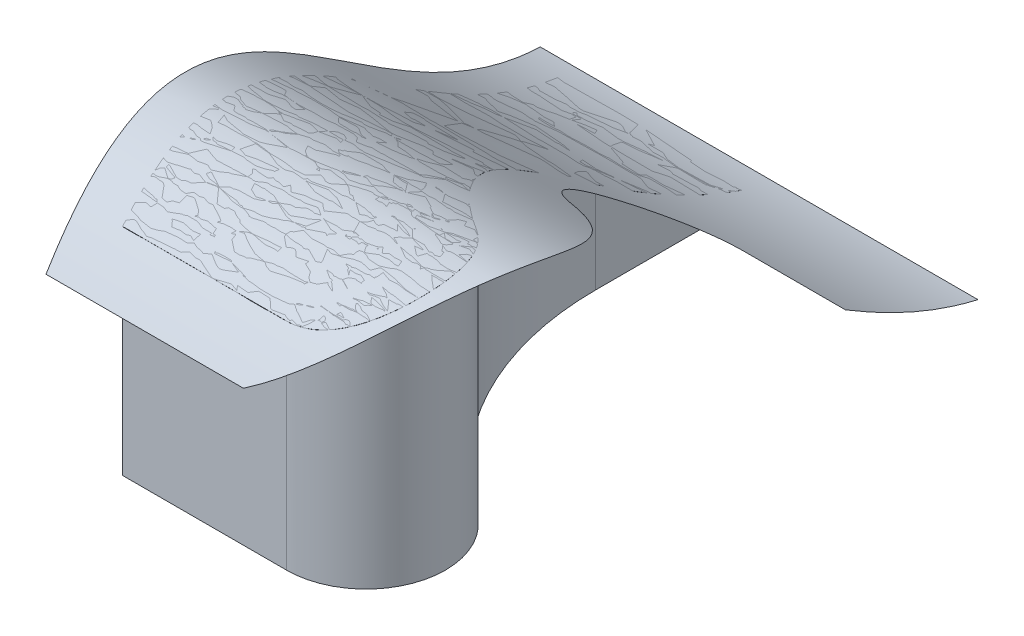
ISO-10303-21;
HEADER;
FILE_DESCRIPTION(('STEP AP214'),'2;1');
FILE_NAME('part.step','',(''),(''),'','','');
FILE_SCHEMA(('AUTOMOTIVE_DESIGN { 1 0 10303 214 1 1 1 1 }'));
ENDSEC;
DATA;
#1=APPLICATION_CONTEXT('core data for automotive mechanical design processes');
#2=APPLICATION_PROTOCOL_DEFINITION('international standard','automotive_design',2000,#1);
#3=PRODUCT_CONTEXT('',#1,'mechanical');
#4=PRODUCT('Part','Part','',(#3));
#5=PRODUCT_RELATED_PRODUCT_CATEGORY('part','',(#4));
#6=PRODUCT_DEFINITION_FORMATION('','',#4);
#7=PRODUCT_DEFINITION_CONTEXT('part definition',#1,'design');
#8=PRODUCT_DEFINITION('design','',#6,#7);
#9=PRODUCT_DEFINITION_SHAPE('','',#8);
#10=(LENGTH_UNIT() NAMED_UNIT(*) SI_UNIT(.MILLI.,.METRE.));
#11=(NAMED_UNIT(*) PLANE_ANGLE_UNIT() SI_UNIT($,.RADIAN.));
#12=(NAMED_UNIT(*) SI_UNIT($,.STERADIAN.) SOLID_ANGLE_UNIT());
#13=UNCERTAINTY_MEASURE_WITH_UNIT(LENGTH_MEASURE(1.E-05),#10,'distance_accuracy_value','');
#14=(GEOMETRIC_REPRESENTATION_CONTEXT(3) GLOBAL_UNCERTAINTY_ASSIGNED_CONTEXT((#13)) GLOBAL_UNIT_ASSIGNED_CONTEXT((#10,
#11,#12)) REPRESENTATION_CONTEXT('',''));
#15=CARTESIAN_POINT('',(0.,0.,0.));
#16=DIRECTION('',(0.,0.,1.));
#17=DIRECTION('',(1.,0.,0.));
#18=AXIS2_PLACEMENT_3D('',#15,#16,#17);
#19=CARTESIAN_POINT('',(-50.8,-4.61815557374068,50.2563988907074));
#20=CARTESIAN_POINT('',(-50.8,81.4124609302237,13.8907957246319));
#21=CARTESIAN_POINT('',(-50.8,-15.5554107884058,-14.6119008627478));
#22=CARTESIAN_POINT('',(-50.8,1.62993726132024,-62.2092721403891));
#23=B_SPLINE_CURVE_WITH_KNOTS('',3,(#19,#20,#21,#22),.UNSPECIFIED.,.F.,.F.,(4,4),(0.,1.),.UNSPECIFIED.);
#24=DIRECTION('',(1.,0.,0.));
#25=VECTOR('',#24,1.);
#26=SURFACE_OF_LINEAR_EXTRUSION('',#23,#25);
#27=DIRECTION('',(1.,0.,0.));
#28=VECTOR('',#27,1.);
#29=CARTESIAN_POINT('',(4.59182488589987,1.32705179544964,-39.379349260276));
#30=LINE('',#29,#28);
#31=CARTESIAN_POINT('',(-17.4066623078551,1.32705179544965,-39.379349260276));
#32=VERTEX_POINT('',#31);
#33=CARTESIAN_POINT('',(6.68799385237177,1.32705179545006,-39.3793492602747));
#34=VERTEX_POINT('',#33);
#35=EDGE_CURVE('E103',#32,#34,#30,.T.);
#36=ORIENTED_EDGE('',*,*,#35,.F.);
#37=CARTESIAN_POINT('',(-2.81317454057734,27.0247550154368,29.6964928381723));
#38=CARTESIAN_POINT('',(-2.86577040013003,27.2133397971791,29.4475391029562));
#39=CARTESIAN_POINT('',(-2.91901082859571,27.3977581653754,29.1955344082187));
#40=CARTESIAN_POINT('',(-3.02687731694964,27.7578038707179,28.6849663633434));
#41=CARTESIAN_POINT('',(-3.08150554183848,27.9334160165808,28.4263927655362));
#42=CARTESIAN_POINT('',(-3.19211366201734,28.2748955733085,27.9028476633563));
#43=CARTESIAN_POINT('',(-3.24809462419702,28.4407549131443,27.6378711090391));
#44=CARTESIAN_POINT('',(-3.36136592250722,28.7618027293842,27.1017202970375));
#45=CARTESIAN_POINT('',(-3.41865651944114,28.9169890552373,26.8305448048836));
#46=CARTESIAN_POINT('',(-3.53462796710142,29.2161457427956,26.2816132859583));
#47=CARTESIAN_POINT('',(-3.59331141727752,29.3600925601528,26.0038449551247));
#48=CARTESIAN_POINT('',(-3.71188550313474,29.6355508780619,25.4425942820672));
#49=CARTESIAN_POINT('',(-3.77177565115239,29.7670672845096,25.159114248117));
#50=CARTESIAN_POINT('',(-3.89269970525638,30.0169103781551,24.5867403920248));
#51=CARTESIAN_POINT('',(-3.95373323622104,30.1352413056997,24.2978483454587));
#52=CARTESIAN_POINT('',(-4.07686955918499,30.35804083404,23.7150030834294));
#53=CARTESIAN_POINT('',(-4.13897232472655,30.4625097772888,23.4210499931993));
#54=CARTESIAN_POINT('',(-4.28585107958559,30.6906847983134,22.7258238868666));
#55=CARTESIAN_POINT('',(-4.37102199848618,30.8085003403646,22.3226815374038));
#56=CARTESIAN_POINT('',(-4.54280534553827,31.0166932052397,21.5095736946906));
#57=CARTESIAN_POINT('',(-4.6294181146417,31.1070639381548,21.099606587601));
#58=CARTESIAN_POINT('',(-4.80368942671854,31.2596779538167,20.2747223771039));
#59=CARTESIAN_POINT('',(-4.8913478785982,31.3219236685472,19.8598057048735));
#60=CARTESIAN_POINT('',(-5.06699950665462,31.4180500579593,19.0283879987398));
#61=CARTESIAN_POINT('',(-5.15499028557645,31.4520336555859,18.6118983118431));
#62=CARTESIAN_POINT('',(-5.33124373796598,31.4925266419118,17.7776319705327));
#63=CARTESIAN_POINT('',(-5.41950642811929,31.4990343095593,17.3598552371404));
#64=CARTESIAN_POINT('',(-5.59593939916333,31.4855967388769,16.5247391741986));
#65=CARTESIAN_POINT('',(-5.68410967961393,31.4656513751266,16.1073998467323));
#66=CARTESIAN_POINT('',(-5.87355613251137,31.3957532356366,15.2106866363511));
#67=CARTESIAN_POINT('',(-5.97476704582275,31.3416650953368,14.7316216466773));
#68=CARTESIAN_POINT('',(-6.17629545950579,31.2028406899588,13.7777204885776));
#69=CARTESIAN_POINT('',(-6.27661275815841,31.1180976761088,13.3028852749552));
#70=CARTESIAN_POINT('',(-6.4760748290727,30.9208789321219,12.3587648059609));
#71=CARTESIAN_POINT('',(-6.57521949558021,30.8084007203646,11.8894800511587));
#72=CARTESIAN_POINT('',(-6.77260954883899,30.5581030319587,10.9551671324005));
#73=CARTESIAN_POINT('',(-6.87084870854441,30.4201694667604,10.4901684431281));
#74=CARTESIAN_POINT('',(-7.06585574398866,30.1222306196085,9.56713514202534));
#75=CARTESIAN_POINT('',(-7.162623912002,29.9622297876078,9.10909914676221));
#76=CARTESIAN_POINT('',(-7.35466498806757,29.6228661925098,8.20010472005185));
#77=CARTESIAN_POINT('',(-7.4499382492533,29.4435080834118,7.74914461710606));
#78=CARTESIAN_POINT('',(-7.63504118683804,29.0757858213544,6.87299071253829));
#79=CARTESIAN_POINT('',(-7.72493069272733,28.8881232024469,6.44751371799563));
#80=CARTESIAN_POINT('',(-7.90344503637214,28.4991597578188,5.60254582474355));
#81=CARTESIAN_POINT('',(-7.99206976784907,28.2978577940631,5.18305542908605));
#82=CARTESIAN_POINT('',(-8.16818669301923,27.8831876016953,4.34943531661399));
#83=CARTESIAN_POINT('',(-8.25567794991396,27.6698100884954,3.93531003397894));
#84=CARTESIAN_POINT('',(-8.4295456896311,27.2326489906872,3.11233606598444));
#85=CARTESIAN_POINT('',(-8.51592211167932,27.008864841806,2.70348766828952));
#86=CARTESIAN_POINT('',(-8.68780040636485,26.5518473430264,1.88993040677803));
#87=CARTESIAN_POINT('',(-8.77330042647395,26.318597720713,1.48523031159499));
#88=CARTESIAN_POINT('',(-8.94336358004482,25.8442256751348,0.680264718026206));
#89=CARTESIAN_POINT('',(-9.02792668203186,25.6031029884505,0.279999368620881));
#90=CARTESIAN_POINT('',(-9.2805653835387,24.8689535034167,-0.915823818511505));
#91=CARTESIAN_POINT('',(-9.44737501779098,24.3657247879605,-1.70538942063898));
#92=CARTESIAN_POINT('',(-9.77832512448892,23.3395542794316,-3.27188659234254));
#93=CARTESIAN_POINT('',(-9.94246599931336,22.8166154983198,-4.04882006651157));
#94=CARTESIAN_POINT('',(-10.2699464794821,21.753186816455,-5.59889433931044));
#95=CARTESIAN_POINT('',(-10.4332726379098,21.2126003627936,-6.37197148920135));
#96=CARTESIAN_POINT('',(-10.758392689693,20.1232699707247,-7.9108730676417));
#97=CARTESIAN_POINT('',(-10.9201885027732,19.5745393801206,-8.67670658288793));
#98=CARTESIAN_POINT('',(-11.2429955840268,18.4729530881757,-10.204660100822));
#99=CARTESIAN_POINT('',(-11.4040073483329,17.9201007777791,-10.9667824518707));
#100=CARTESIAN_POINT('',(-11.7259327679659,16.8138968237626,-12.4905627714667));
#101=CARTESIAN_POINT('',(-11.8868464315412,16.2605452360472,-13.2522207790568));
#102=CARTESIAN_POINT('',(-12.2092270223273,15.1567254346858,-14.7781555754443));
#103=CARTESIAN_POINT('',(-12.3706941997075,14.6062589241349,-15.542433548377));
#104=CARTESIAN_POINT('',(-12.659136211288,13.6320124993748,-16.9077257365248));
#105=CARTESIAN_POINT('',(-12.7859180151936,13.2068977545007,-17.5078262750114));
#106=CARTESIAN_POINT('',(-13.0403744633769,12.3624345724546,-18.7122534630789));
#107=CARTESIAN_POINT('',(-13.1680494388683,11.9430884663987,-19.3165816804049));
#108=CARTESIAN_POINT('',(-13.4244653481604,11.1121800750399,-20.5302836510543));
#109=CARTESIAN_POINT('',(-13.5532062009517,10.7006172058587,-21.139657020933));
#110=CARTESIAN_POINT('',(-13.8119309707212,9.88732216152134,-22.3642875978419));
#111=CARTESIAN_POINT('',(-13.9419143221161,9.48558578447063,-22.979542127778));
#112=CARTESIAN_POINT('',(-14.2033076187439,8.69403789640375,-24.2168037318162));
#113=CARTESIAN_POINT('',(-14.3347165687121,8.30421871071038,-24.8388060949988));
#114=CARTESIAN_POINT('',(-14.5991535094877,7.53866547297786,-26.090474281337));
#115=CARTESIAN_POINT('',(-14.7321802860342,7.16292162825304,-26.7201343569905));
#116=CARTESIAN_POINT('',(-15.0003728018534,6.42689955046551,-27.9895789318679));
#117=CARTESIAN_POINT('',(-15.1355419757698,6.06665053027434,-28.6293796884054));
#118=CARTESIAN_POINT('',(-15.4079385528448,5.36492059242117,-29.9187234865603));
#119=CARTESIAN_POINT('',(-15.5451657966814,5.02343823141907,-30.5682657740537));
#120=CARTESIAN_POINT('',(-15.8219079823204,4.36178140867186,-31.8781787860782));
#121=CARTESIAN_POINT('',(-15.9614242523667,4.04161990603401,-32.5385557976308));
#122=CARTESIAN_POINT('',(-16.2429889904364,3.42532273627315,-33.8712955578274));
#123=CARTESIAN_POINT('',(-16.3850412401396,3.12922738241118,-34.5436762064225));
#124=CARTESIAN_POINT('',(-16.6719487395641,2.56398368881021,-35.9017050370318));
#125=CARTESIAN_POINT('',(-16.8168113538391,2.2949223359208,-36.5873880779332));
#126=CARTESIAN_POINT('',(-17.1096114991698,1.78694056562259,-37.973308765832));
#127=CARTESIAN_POINT('',(-17.2575609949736,1.54818190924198,-38.6736030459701));
#128=CARTESIAN_POINT('',(-17.4066623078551,1.32705179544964,-39.379349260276));
#129=B_SPLINE_CURVE_WITH_KNOTS('',3,(#37,#38,#39,#40,#41,#42,#43,#44,#45,#46,#47,#48,#49,#50,
#51,#52,#53,#54,#55,#56,#57,#58,#59,#60,#61,#62,#63,#64,#65,#66,#67,#68,#69,#70,#71,#72,#73,#74,
#75,#76,#77,#78,#79,#80,#81,#82,#83,#84,#85,#86,#87,#88,#89,#90,#91,#92,#93,#94,#95,#96,#97,#98,
#99,#100,#101,#102,#103,#104,#105,#106,#107,#108,#109,#110,#111,#112,#113,#114,#115,#116,#117,
#118,#119,#120,#121,#122,#123,#124,#125,#126,#127,#128),.UNSPECIFIED.,.F.,.F.,(4,2,2,2,2,2,2,2,
2,2,2,2,2,2,2,2,2,2,2,2,2,2,2,2,2,2,2,2,2,2,2,2,2,2,2,2,2,2,2,2,2,2,2,2,2,4),(0.,
0.95013908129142,1.90186448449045,2.85436672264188,3.8070603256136,4.76169886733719,
5.71595905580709,6.66991147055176,7.62384031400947,8.90854631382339,10.193560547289,
11.4784636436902,12.7586667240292,14.0389499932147,15.3192393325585,16.7960093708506,
18.2731047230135,19.750332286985,21.2343489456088,22.7180667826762,24.2014286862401,
25.6220655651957,27.0428211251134,28.4646843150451,29.8866246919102,31.3111227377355,
32.7356684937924,35.5883345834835,38.4405665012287,41.3125748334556,44.1803059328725,
47.045892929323,49.9111912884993,52.7780243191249,55.0168052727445,57.2564658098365,
59.4959576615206,61.7344745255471,63.9715180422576,66.2069751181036,68.4464769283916,
70.6858062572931,72.9264844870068,75.1708418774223,77.4222039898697,79.6851195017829),.UNSPECIFIED.);
#130=CARTESIAN_POINT('',(-2.81317454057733,27.0247550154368,29.6964928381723));
#131=VERTEX_POINT('',#130);
#132=EDGE_CURVE('E109',#131,#32,#129,.T.);
#133=ORIENTED_EDGE('',*,*,#132,.F.);
#134=DIRECTION('',(1.,0.,0.));
#135=VECTOR('',#134,1.);
#136=CARTESIAN_POINT('',(4.59182488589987,27.0247550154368,29.6964928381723));
#137=LINE('',#136,#135);
#138=CARTESIAN_POINT('',(17.7258082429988,27.0247550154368,29.6964928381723));
#139=VERTEX_POINT('',#138);
#140=EDGE_CURVE('E159',#139,#131,#137,.F.);
#141=ORIENTED_EDGE('',*,*,#140,.F.);
#142=CARTESIAN_POINT('',(23.3470035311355,30.7133704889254,11.5357080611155));
#143=CARTESIAN_POINT('',(23.5765390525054,30.7547322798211,11.6928392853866));
#144=CARTESIAN_POINT('',(23.7993347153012,30.7971264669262,11.8595273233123));
#145=CARTESIAN_POINT('',(24.2301638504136,30.8824133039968,12.21091579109));
#146=CARTESIAN_POINT('',(24.43819626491,30.9253059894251,12.3956175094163));
#147=CARTESIAN_POINT('',(24.8387375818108,31.0101345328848,12.7824446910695));
#148=CARTESIAN_POINT('',(25.0312018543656,31.0520674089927,12.9846170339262));
#149=CARTESIAN_POINT('',(25.398713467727,31.1331717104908,13.4047296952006));
#150=CARTESIAN_POINT('',(25.5737613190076,31.1723432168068,13.6226695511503));
#151=CARTESIAN_POINT('',(25.9054902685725,31.2462644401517,14.0733703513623));
#152=CARTESIAN_POINT('',(26.062141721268,31.281007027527,14.3061543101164));
#153=CARTESIAN_POINT('',(26.3555475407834,31.3442528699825,14.7847403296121));
#154=CARTESIAN_POINT('',(26.4923033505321,31.3727565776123,15.0305414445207));
#155=CARTESIAN_POINT('',(26.7446029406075,31.4217923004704,15.5331334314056));
#156=CARTESIAN_POINT('',(26.8601769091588,31.4423357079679,15.7899080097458));
#157=CARTESIAN_POINT('',(27.0693036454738,31.4739268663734,16.3128425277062));
#158=CARTESIAN_POINT('',(27.1628579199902,31.4849752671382,16.5790018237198));
#159=CARTESIAN_POINT('',(27.3231037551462,31.4959320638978,17.1054747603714));
#160=CARTESIAN_POINT('',(27.3908751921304,31.4963531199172,17.3654490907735));
#161=CARTESIAN_POINT('',(27.5051401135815,31.4864211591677,17.8898353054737));
#162=CARTESIAN_POINT('',(27.5516343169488,31.4760685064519,18.1542470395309));
#163=CARTESIAN_POINT('',(27.6230562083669,31.4439791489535,18.6852582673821));
#164=CARTESIAN_POINT('',(27.6479859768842,31.4222435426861,18.9518575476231));
#165=CARTESIAN_POINT('',(27.676300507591,31.3671488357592,19.4849903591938));
#166=CARTESIAN_POINT('',(27.6796861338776,31.3337902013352,19.7515238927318));
#167=CARTESIAN_POINT('',(27.6657405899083,31.2583164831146,20.2639055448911));
#168=CARTESIAN_POINT('',(27.6498284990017,31.2169682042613,20.5099074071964));
#169=CARTESIAN_POINT('',(27.6001029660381,31.1247552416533,20.9982695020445));
#170=CARTESIAN_POINT('',(27.5662905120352,31.0738910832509,21.2406299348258));
#171=CARTESIAN_POINT('',(27.4813976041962,30.9632987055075,21.7202480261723));
#172=CARTESIAN_POINT('',(27.430316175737,30.9035699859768,21.9575053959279));
#173=CARTESIAN_POINT('',(27.3116266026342,30.7761025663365,22.4256419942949));
#174=CARTESIAN_POINT('',(27.2440176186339,30.7083634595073,22.6565208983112));
#175=CARTESIAN_POINT('',(27.0893976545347,30.5624152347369,23.1218674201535));
#176=CARTESIAN_POINT('',(27.0016042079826,30.4838575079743,23.3559652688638));
#177=CARTESIAN_POINT('',(26.8095855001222,30.3202711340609,23.8150838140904));
#178=CARTESIAN_POINT('',(26.7053532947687,30.2352397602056,24.0401006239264));
#179=CARTESIAN_POINT('',(26.4812978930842,30.0600480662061,24.48024898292));
#180=CARTESIAN_POINT('',(26.3614692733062,29.9698859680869,24.6953770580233));
#181=CARTESIAN_POINT('',(26.1070115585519,29.7858450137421,25.1150371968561));
#182=CARTESIAN_POINT('',(25.9723810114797,29.6919657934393,25.3195682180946));
#183=CARTESIAN_POINT('',(25.668401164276,29.4881053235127,25.746380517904));
#184=CARTESIAN_POINT('',(25.4968492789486,29.3777657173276,25.9669255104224));
#185=CARTESIAN_POINT('',(25.1360485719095,29.1562505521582,26.3926153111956));
#186=CARTESIAN_POINT('',(24.9467975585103,29.0450748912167,26.5977582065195));
#187=CARTESIAN_POINT('',(24.5512124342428,28.8240837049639,26.9919187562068));
#188=CARTESIAN_POINT('',(24.3448691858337,28.7142689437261,27.1809276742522));
#189=CARTESIAN_POINT('',(23.9158369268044,28.4984110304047,27.5417514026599));
#190=CARTESIAN_POINT('',(23.693149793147,28.3923674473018,27.7135681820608));
#191=CARTESIAN_POINT('',(23.2541153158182,28.196344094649,28.0233625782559));
#192=CARTESIAN_POINT('',(23.0391954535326,28.1057976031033,28.1630048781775));
#193=CARTESIAN_POINT('',(22.5971144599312,27.931710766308,28.4263495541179));
#194=CARTESIAN_POINT('',(22.3699553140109,27.8481692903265,28.5500545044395));
#195=CARTESIAN_POINT('',(21.904775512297,27.6902689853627,28.7801241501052));
#196=CARTESIAN_POINT('',(21.6667862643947,27.6158856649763,28.8865353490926));
#197=CARTESIAN_POINT('',(21.1804279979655,27.4780168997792,29.0812187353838));
#198=CARTESIAN_POINT('',(20.9320596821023,27.4145307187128,29.1694921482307));
#199=CARTESIAN_POINT('',(20.4451176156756,27.3045901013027,29.3208443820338));
#200=CARTESIAN_POINT('',(20.2071807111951,27.2572225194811,29.3853049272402));
#201=CARTESIAN_POINT('',(19.725182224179,27.1748274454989,29.4966880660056));
#202=CARTESIAN_POINT('',(19.4811220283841,27.1397971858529,29.5436145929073));
#203=CARTESIAN_POINT('',(18.986458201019,27.0829164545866,29.6195078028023));
#204=CARTESIAN_POINT('',(18.7358162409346,27.0611825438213,29.6483157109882));
#205=CARTESIAN_POINT('',(18.3580945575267,27.0393677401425,29.6771888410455));
#206=CARTESIAN_POINT('',(18.2318192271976,27.0338937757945,29.6844234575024));
#207=CARTESIAN_POINT('',(17.9789719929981,27.0265857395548,29.6940763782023));
#208=CARTESIAN_POINT('',(17.8524000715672,27.0247518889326,29.6964943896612));
#209=CARTESIAN_POINT('',(17.7258082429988,27.0247550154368,29.6964928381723));
#210=B_SPLINE_CURVE_WITH_KNOTS('',3,(#142,#143,#144,#145,#146,#147,#148,#149,#150,#151,#152,
#153,#154,#155,#156,#157,#158,#159,#160,#161,#162,#163,#164,#165,#166,#167,#168,#169,#170,#171,
#172,#173,#174,#175,#176,#177,#178,#179,#180,#181,#182,#183,#184,#185,#186,#187,#188,#189,#190,
#191,#192,#193,#194,#195,#196,#197,#198,#199,#200,#201,#202,#203,#204,#205,#206,#207,#208,#209),
.UNSPECIFIED.,.F.,.F.,(4,2,2,2,2,2,2,2,2,2,2,2,2,2,2,2,2,2,2,2,2,2,2,2,2,2,2,2,2,2,2,2,2,4),(0.,
0.843420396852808,1.68690116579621,2.53272007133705,3.37851417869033,4.22565309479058,
5.07273054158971,5.91859118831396,6.76439393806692,7.56931313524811,8.37420513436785,
9.17901947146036,9.98380152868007,10.732825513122,11.4818081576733,12.230833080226,
12.9798960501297,13.7653179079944,14.5510724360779,15.337100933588,16.1232066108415,
17.0234829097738,17.9238708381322,18.824743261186,19.725512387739,20.540209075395,
21.3547740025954,22.1671109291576,22.9793929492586,23.7315185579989,24.4834753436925,
25.2419329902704,25.6216098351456,26.0013097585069),.UNSPECIFIED.);
#211=CARTESIAN_POINT('',(23.3470035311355,30.7133704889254,11.5357080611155));
#212=VERTEX_POINT('',#211);
#213=EDGE_CURVE('E155',#212,#139,#210,.T.);
#214=ORIENTED_EDGE('',*,*,#213,.F.);
#215=CARTESIAN_POINT('',(6.68799385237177,11.4349415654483,-20.0589654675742));
#216=CARTESIAN_POINT('',(6.68799724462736,11.6618463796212,-19.7268533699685));
#217=CARTESIAN_POINT('',(6.69231444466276,11.8899067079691,-19.3955511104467));
#218=CARTESIAN_POINT('',(6.70947825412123,12.3479507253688,-18.7345106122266));
#219=CARTESIAN_POINT('',(6.72232467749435,12.5779343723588,-18.4047723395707));
#220=CARTESIAN_POINT('',(6.77356075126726,13.2708797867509,-17.4168345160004));
#221=CARTESIAN_POINT('',(6.82464665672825,13.736169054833,-16.7608845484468));
#222=CARTESIAN_POINT('',(6.96023220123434,14.6702383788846,-15.4539754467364));
#223=CARTESIAN_POINT('',(7.04476597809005,15.1390215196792,-14.8030221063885));
#224=CARTESIAN_POINT('',(7.24719065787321,16.0767503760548,-13.5059843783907));
#225=CARTESIAN_POINT('',(7.36509637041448,16.5456960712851,-12.859902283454));
#226=CARTESIAN_POINT('',(7.63713846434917,17.489537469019,-11.5598979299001));
#227=CARTESIAN_POINT('',(7.79193679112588,17.9643707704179,-10.9060686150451));
#228=CARTESIAN_POINT('',(8.13704750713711,18.9071514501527,-9.60321953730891));
#229=CARTESIAN_POINT('',(8.32734569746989,19.3751015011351,-8.95419795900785));
#230=CARTESIAN_POINT('',(8.74438808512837,20.3004729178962,-7.66093519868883));
#231=CARTESIAN_POINT('',(8.97111166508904,20.7579000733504,-7.01669152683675));
#232=CARTESIAN_POINT('',(9.46232774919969,21.6585700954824,-5.7329931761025));
#233=CARTESIAN_POINT('',(9.72680600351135,22.1018182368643,-5.09353678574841));
#234=CARTESIAN_POINT('',(10.1847413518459,22.8015651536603,-4.0672390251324));
#235=CARTESIAN_POINT('',(10.365889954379,23.0637368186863,-3.67873846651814));
#236=CARTESIAN_POINT('',(10.7432878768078,23.5803430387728,-2.90395314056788));
#237=CARTESIAN_POINT('',(10.9395361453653,23.8347781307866,-2.51766822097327));
#238=CARTESIAN_POINT('',(11.3475054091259,24.334910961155,-1.7476603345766));
#239=CARTESIAN_POINT('',(11.5592252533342,24.5806093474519,-1.36393717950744));
#240=CARTESIAN_POINT('',(11.9985430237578,25.062305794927,-0.599417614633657));
#241=CARTESIAN_POINT('',(12.2261426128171,25.2983028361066,-0.218621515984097));
#242=CARTESIAN_POINT('',(12.6953371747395,25.7574070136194,0.535921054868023));
#243=CARTESIAN_POINT('',(12.9367820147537,25.9806137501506,0.909700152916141));
#244=CARTESIAN_POINT('',(13.4358551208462,26.4155385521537,1.65318929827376));
#245=CARTESIAN_POINT('',(13.6934847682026,26.6272556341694,2.02289899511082));
#246=CARTESIAN_POINT('',(14.2250714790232,27.0382356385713,2.75740854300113));
#247=CARTESIAN_POINT('',(14.4990267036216,27.2374999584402,3.12220894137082));
#248=CARTESIAN_POINT('',(15.0633597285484,27.6227376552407,3.84603065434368));
#249=CARTESIAN_POINT('',(15.3537358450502,27.8087123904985,4.2050525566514));
#250=CARTESIAN_POINT('',(15.9199881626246,28.1481290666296,4.87954255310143));
#251=CARTESIAN_POINT('',(16.1942536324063,28.302945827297,5.19567193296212));
#252=CARTESIAN_POINT('',(16.7558713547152,28.6009057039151,5.82176409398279));
#253=CARTESIAN_POINT('',(17.0432237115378,28.7440487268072,6.1317268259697));
#254=CARTESIAN_POINT('',(17.6307929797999,29.0183424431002,6.74465910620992));
#255=CARTESIAN_POINT('',(17.9310092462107,29.1494937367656,7.04762900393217));
#256=CARTESIAN_POINT('',(18.5440139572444,29.3996358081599,7.64575428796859));
#257=CARTESIAN_POINT('',(18.8568020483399,29.5186269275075,7.94090989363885));
#258=CARTESIAN_POINT('',(19.4994578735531,29.7461572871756,8.52703771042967));
#259=CARTESIAN_POINT('',(19.8295138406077,29.8545085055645,8.81787658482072));
#260=CARTESIAN_POINT('',(20.5017393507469,30.0588048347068,9.3898215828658));
#261=CARTESIAN_POINT('',(20.8439101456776,30.1547486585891,9.67092669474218));
#262=CARTESIAN_POINT('',(21.5398604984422,30.3345382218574,10.2226180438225));
#263=CARTESIAN_POINT('',(21.893642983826,30.4183808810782,10.4932015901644));
#264=CARTESIAN_POINT('',(22.6122360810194,30.5744652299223,11.0231146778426));
#265=CARTESIAN_POINT('',(22.9770506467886,30.6467027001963,11.2824401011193));
#266=CARTESIAN_POINT('',(23.3470035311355,30.7133704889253,11.5357080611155));
#267=B_SPLINE_CURVE_WITH_KNOTS('',3,(#215,#216,#217,#218,#219,#220,#221,#222,#223,#224,#225,
#226,#227,#228,#229,#230,#231,#232,#233,#234,#235,#236,#237,#238,#239,#240,#241,#242,#243,#244,
#245,#246,#247,#248,#249,#250,#251,#252,#253,#254,#255,#256,#257,#258,#259,#260,#261,#262,#263,
#264,#265,#266),.UNSPECIFIED.,.F.,.F.,(4,2,2,2,2,2,2,2,2,2,2,2,2,2,2,2,2,2,2,2,2,2,2,2,2,4),(0.,
1.2066157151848,2.41320511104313,4.82991878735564,7.24910541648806,9.66936730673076,
12.1368458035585,14.6033394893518,17.0684419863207,19.532616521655,21.0397907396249,
22.5468601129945,24.05381748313,25.5609328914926,27.054008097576,28.5472109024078,
30.0402458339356,31.5331279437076,32.8714675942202,34.2098179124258,35.5481012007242,
36.8863468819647,38.245091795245,39.6039775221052,40.9632085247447,42.3229325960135),.UNSPECIFIED.);
#268=CARTESIAN_POINT('',(6.68799385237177,11.4349415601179,-20.0589654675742));
#269=VERTEX_POINT('',#268);
#270=EDGE_CURVE('E67',#269,#212,#267,.T.);
#271=ORIENTED_EDGE('',*,*,#270,.F.);
#272=CARTESIAN_POINT('',(6.68799385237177,-4.61815557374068,50.2563988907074));
#273=CARTESIAN_POINT('',(6.68799385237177,81.4124609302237,13.8907957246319));
#274=CARTESIAN_POINT('',(6.68799385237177,-15.5554107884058,-14.6119008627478));
#275=CARTESIAN_POINT('',(6.68799385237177,1.62993726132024,-62.2092721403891));
#276=B_SPLINE_CURVE_WITH_KNOTS('',3,(#272,#273,#274,#275),.UNSPECIFIED.,.F.,.F.,(4,4),(0.,1.),.UNSPECIFIED.);
#277=EDGE_CURVE('E12',#34,#269,#276,.F.);
#278=ORIENTED_EDGE('',*,*,#277,.F.);
#279=EDGE_LOOP('',(#36,#133,#141,#214,#271,#278));
#280=FACE_BOUND('',#279,.T.);
#281=ADVANCED_FACE('F50',(#280),#26,.F.);
#282=CARTESIAN_POINT('',(6.68799385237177,101.6,-39.379349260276));
#283=DIRECTION('',(0.,0.,1.));
#284=DIRECTION('',(1.,0.,0.));
#285=AXIS2_PLACEMENT_3D('',#282,#283,#284);
#286=PLANE('',#285);
#287=DIRECTION('',(0.,-1.,0.));
#288=VECTOR('',#287,1.);
#289=CARTESIAN_POINT('',(-17.4066623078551,101.6,-39.379349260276));
#290=LINE('',#289,#288);
#291=CARTESIAN_POINT('',(-17.4066623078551,0.,-39.379349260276));
#292=VERTEX_POINT('',#291);
#293=EDGE_CURVE('E60',#32,#292,#290,.T.);
#294=ORIENTED_EDGE('',*,*,#293,.F.);
#295=ORIENTED_EDGE('',*,*,#35,.T.);
#296=DIRECTION('',(0.,-1.,0.));
#297=VECTOR('',#296,1.);
#298=CARTESIAN_POINT('',(6.68799385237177,101.6,-39.379349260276));
#299=LINE('',#298,#297);
#300=CARTESIAN_POINT('',(6.68799385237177,0.,-39.379349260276));
#301=VERTEX_POINT('',#300);
#302=EDGE_CURVE('E74',#34,#301,#299,.T.);
#303=ORIENTED_EDGE('',*,*,#302,.T.);
#304=DIRECTION('',(-1.,0.,0.));
#305=VECTOR('',#304,1.);
#306=CARTESIAN_POINT('',(6.68799385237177,0.,-39.379349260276));
#307=LINE('',#306,#305);
#308=EDGE_CURVE('E108',#301,#292,#307,.T.);
#309=ORIENTED_EDGE('',*,*,#308,.T.);
#310=EDGE_LOOP('',(#294,#295,#303,#309));
#311=FACE_BOUND('',#310,.T.);
#312=ADVANCED_FACE('F52',(#311),#286,.F.);
#313=CARTESIAN_POINT('',(-17.4066623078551,101.6,-39.379349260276));
#314=DIRECTION('',(0.97840332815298,0.,-0.206704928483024));
#315=DIRECTION('',(-0.206704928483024,0.,-0.97840332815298));
#316=AXIS2_PLACEMENT_3D('',#313,#314,#315);
#317=PLANE('',#316);
#318=DIRECTION('',(0.,-1.,0.));
#319=VECTOR('',#318,1.);
#320=CARTESIAN_POINT('',(-2.81317454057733,101.6,29.6964928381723));
#321=LINE('',#320,#319);
#322=CARTESIAN_POINT('',(-2.81317454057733,0.,29.6964928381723));
#323=VERTEX_POINT('',#322);
#324=EDGE_CURVE('E126',#131,#323,#321,.T.);
#325=ORIENTED_EDGE('',*,*,#324,.F.);
#326=ORIENTED_EDGE('',*,*,#132,.T.);
#327=ORIENTED_EDGE('',*,*,#293,.T.);
#328=DIRECTION('',(0.206704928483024,0.,0.97840332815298));
#329=VECTOR('',#328,1.);
#330=CARTESIAN_POINT('',(-17.4066623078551,0.,-39.379349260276));
#331=LINE('',#330,#329);
#332=EDGE_CURVE('E132',#292,#323,#331,.T.);
#333=ORIENTED_EDGE('',*,*,#332,.T.);
#334=EDGE_LOOP('',(#325,#326,#327,#333));
#335=FACE_BOUND('',#334,.T.);
#336=ADVANCED_FACE('F131',(#335),#317,.F.);
#337=CARTESIAN_POINT('',(-2.81317454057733,101.6,29.6964928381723));
#338=DIRECTION('',(0.,0.,-1.));
#339=DIRECTION('',(-1.,0.,0.));
#340=AXIS2_PLACEMENT_3D('',#337,#338,#339);
#341=PLANE('',#340);
#342=DIRECTION('',(0.,-1.,0.));
#343=VECTOR('',#342,1.);
#344=CARTESIAN_POINT('',(17.7258082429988,101.6,29.6964928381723));
#345=LINE('',#344,#343);
#346=CARTESIAN_POINT('',(17.7258082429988,0.,29.6964928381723));
#347=VERTEX_POINT('',#346);
#348=EDGE_CURVE('E124',#139,#347,#345,.T.);
#349=ORIENTED_EDGE('',*,*,#348,.F.);
#350=ORIENTED_EDGE('',*,*,#140,.T.);
#351=ORIENTED_EDGE('',*,*,#324,.T.);
#352=DIRECTION('',(1.,0.,0.));
#353=VECTOR('',#352,1.);
#354=CARTESIAN_POINT('',(-2.81317454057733,0.,29.6964928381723));
#355=LINE('',#354,#353);
#356=EDGE_CURVE('E138',#323,#347,#355,.T.);
#357=ORIENTED_EDGE('',*,*,#356,.T.);
#358=EDGE_LOOP('',(#349,#350,#351,#357));
#359=FACE_BOUND('',#358,.T.);
#360=ADVANCED_FACE('F158',(#359),#341,.F.);
#361=CARTESIAN_POINT('',(17.7258082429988,101.6,19.7461535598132));
#362=DIRECTION('',(0.,-1.,0.));
#363=DIRECTION('',(0.,0.,-1.));
#364=AXIS2_PLACEMENT_3D('',#361,#362,#363);
#365=CYLINDRICAL_SURFACE('',#364,9.95033927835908);
#366=DIRECTION('',(0.,-1.,0.));
#367=VECTOR('',#366,1.);
#368=CARTESIAN_POINT('',(23.3470035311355,101.6,11.5357080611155));
#369=LINE('',#368,#367);
#370=CARTESIAN_POINT('',(23.3470035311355,0.,11.5357080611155));
#371=VERTEX_POINT('',#370);
#372=EDGE_CURVE('E117',#212,#371,#369,.T.);
#373=ORIENTED_EDGE('',*,*,#372,.F.);
#374=ORIENTED_EDGE('',*,*,#213,.T.);
#375=ORIENTED_EDGE('',*,*,#348,.T.);
#376=CARTESIAN_POINT('',(17.7258082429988,0.,19.7461535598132));
#377=DIRECTION('',(0.,1.,0.));
#378=DIRECTION('',(0.,0.,1.));
#379=AXIS2_PLACEMENT_3D('',#376,#377,#378);
#380=CIRCLE('',#379,9.95033927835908);
#381=EDGE_CURVE('E144',#347,#371,#380,.T.);
#382=ORIENTED_EDGE('',*,*,#381,.T.);
#383=EDGE_LOOP('',(#373,#374,#375,#382));
#384=FACE_BOUND('',#383,.T.);
#385=ADVANCED_FACE('F152',(#384),#365,.T.);
#386=CARTESIAN_POINT('',(44.9779649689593,101.6,-20.0589654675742));
#387=DIRECTION('',(0.,-1.,0.));
#388=DIRECTION('',(0.,0.,-1.));
#389=AXIS2_PLACEMENT_3D('',#386,#387,#388);
#390=CYLINDRICAL_SURFACE('',#389,38.2899711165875);
#391=DIRECTION('',(0.,-1.,0.));
#392=VECTOR('',#391,1.);
#393=CARTESIAN_POINT('',(6.68799385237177,101.6,-20.0589654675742));
#394=LINE('',#393,#392);
#395=CARTESIAN_POINT('',(6.68799385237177,0.,-20.0589654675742));
#396=VERTEX_POINT('',#395);
#397=EDGE_CURVE('E115',#269,#396,#394,.T.);
#398=ORIENTED_EDGE('',*,*,#397,.F.);
#399=ORIENTED_EDGE('',*,*,#270,.T.);
#400=ORIENTED_EDGE('',*,*,#372,.T.);
#401=CARTESIAN_POINT('',(44.9779649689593,0.,-20.0589654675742));
#402=DIRECTION('',(0.,-1.,0.));
#403=DIRECTION('',(0.,0.,-1.));
#404=AXIS2_PLACEMENT_3D('',#401,#402,#403);
#405=CIRCLE('',#404,38.2899711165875);
#406=EDGE_CURVE('E119',#371,#396,#405,.T.);
#407=ORIENTED_EDGE('',*,*,#406,.T.);
#408=EDGE_LOOP('',(#398,#399,#400,#407));
#409=FACE_BOUND('',#408,.T.);
#410=ADVANCED_FACE('F149',(#409),#390,.F.);
#411=CARTESIAN_POINT('',(6.68799385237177,101.6,-20.0589654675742));
#412=DIRECTION('',(-1.,0.,0.));
#413=DIRECTION('',(0.,0.,1.));
#414=AXIS2_PLACEMENT_3D('',#411,#412,#413);
#415=PLANE('',#414);
#416=ORIENTED_EDGE('',*,*,#302,.F.);
#417=ORIENTED_EDGE('',*,*,#277,.T.);
#418=ORIENTED_EDGE('',*,*,#397,.T.);
#419=DIRECTION('',(0.,0.,-1.));
#420=VECTOR('',#419,1.);
#421=CARTESIAN_POINT('',(6.68799385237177,0.,-20.0589654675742));
#422=LINE('',#421,#420);
#423=EDGE_CURVE('E113',#396,#301,#422,.T.);
#424=ORIENTED_EDGE('',*,*,#423,.T.);
#425=EDGE_LOOP('',(#416,#417,#418,#424));
#426=FACE_BOUND('',#425,.T.);
#427=ADVANCED_FACE('F111',(#426),#415,.F.);
#428=CARTESIAN_POINT('',(17.7258082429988,0.,19.7461535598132));
#429=DIRECTION('',(0.,1.,0.));
#430=DIRECTION('',(0.,0.,1.));
#431=AXIS2_PLACEMENT_3D('',#428,#429,#430);
#432=PLANE('',#431);
#433=ORIENTED_EDGE('',*,*,#308,.F.);
#434=ORIENTED_EDGE('',*,*,#423,.F.);
#435=ORIENTED_EDGE('',*,*,#406,.F.);
#436=ORIENTED_EDGE('',*,*,#381,.F.);
#437=ORIENTED_EDGE('',*,*,#356,.F.);
#438=ORIENTED_EDGE('',*,*,#332,.F.);
#439=EDGE_LOOP('',(#433,#434,#435,#436,#437,#438));
#440=FACE_BOUND('',#439,.T.);
#441=ADVANCED_FACE('F135',(#440),#432,.F.);
#442=CLOSED_SHELL('',(#281,#312,#336,#360,#385,#410,#427,#441));
#443=MANIFOLD_SOLID_BREP('B2',#442);
#444=CARTESIAN_POINT('',(-50.8,-4.61815557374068,50.2563988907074));
#445=CARTESIAN_POINT('',(-50.8,81.4124609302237,13.8907957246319));
#446=CARTESIAN_POINT('',(-50.8,-15.5554107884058,-14.6119008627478));
#447=CARTESIAN_POINT('',(-50.8,1.62993726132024,-62.2092721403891));
#448=B_SPLINE_CURVE_WITH_KNOTS('',3,(#444,#445,#446,#447),.UNSPECIFIED.,.F.,.F.,(4,4),(0.,1.),.UNSPECIFIED.);
#449=DIRECTION('',(1.,0.,0.));
#450=VECTOR('',#449,1.);
#451=SURFACE_OF_LINEAR_EXTRUSION('',#448,#450);
#452=CARTESIAN_POINT('',(-7.26417737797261,22.1795320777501,34.8413219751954));
#453=CARTESIAN_POINT('',(-7.33516467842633,22.5826225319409,34.4847880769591));
#454=CARTESIAN_POINT('',(-7.40753983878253,22.9794122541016,34.1212563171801));
#455=CARTESIAN_POINT('',(-7.5551825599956,23.7576071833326,33.3796457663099));
#456=CARTESIAN_POINT('',(-7.63044637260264,24.1390310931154,33.0015858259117));
#457=CARTESIAN_POINT('',(-7.78387756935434,24.8833636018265,32.2308975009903));
#458=CARTESIAN_POINT('',(-7.86203324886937,25.2463351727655,31.8383278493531));
#459=CARTESIAN_POINT('',(-8.02125847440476,25.9505731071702,31.038586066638));
#460=CARTESIAN_POINT('',(-8.1023096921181,26.2919475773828,30.6315058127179));
#461=CARTESIAN_POINT('',(-8.2673315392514,26.9498769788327,29.8027175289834));
#462=CARTESIAN_POINT('',(-8.35127957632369,27.266579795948,29.38112274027));
#463=CARTESIAN_POINT('',(-8.52211104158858,27.8721667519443,28.5232103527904));
#464=CARTESIAN_POINT('',(-8.60897087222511,28.1612239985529,28.0870111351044));
#465=CARTESIAN_POINT('',(-8.74162850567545,28.5722886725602,27.4208069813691));
#466=CARTESIAN_POINT('',(-8.78613886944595,28.7052806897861,27.1972744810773));
#467=CARTESIAN_POINT('',(-8.87588696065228,28.9632509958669,26.7465471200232));
#468=CARTESIAN_POINT('',(-8.9211225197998,29.0882490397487,26.5193631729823));
#469=CARTESIAN_POINT('',(-9.00638560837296,29.3141690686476,26.091128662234));
#470=CARTESIAN_POINT('',(-9.04631263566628,29.4160914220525,25.8905858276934));
#471=CARTESIAN_POINT('',(-9.10756793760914,29.5664099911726,25.5829112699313));
#472=CARTESIAN_POINT('',(-9.12867923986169,29.6171388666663,25.4768719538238));
#473=CARTESIAN_POINT('',(-9.17166296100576,29.7182126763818,25.2609704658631));
#474=CARTESIAN_POINT('',(-9.19353999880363,29.7685060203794,25.1510850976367));
#475=CARTESIAN_POINT('',(-9.27298236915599,29.9469262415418,24.7520597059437));
#476=CARTESIAN_POINT('',(-9.33104034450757,30.0693753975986,24.4604496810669));
#477=CARTESIAN_POINT('',(-9.45187983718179,30.3073984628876,23.8535243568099));
#478=CARTESIAN_POINT('',(-9.51472978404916,30.4220643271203,23.5378665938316));
#479=CARTESIAN_POINT('',(-9.64516304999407,30.640830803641,22.8827991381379));
#480=CARTESIAN_POINT('',(-9.7128102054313,30.743939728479,22.5430700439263));
#481=CARTESIAN_POINT('',(-9.85284358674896,30.9358154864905,21.8397925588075));
#482=CARTESIAN_POINT('',(-9.92528684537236,31.0234913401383,21.4759566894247));
#483=CARTESIAN_POINT('',(-10.0594279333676,31.1644117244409,20.80226948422));
#484=CARTESIAN_POINT('',(-10.1209953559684,31.2209182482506,20.4930703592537));
#485=CARTESIAN_POINT('',(-10.2387376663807,31.3134895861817,19.9017950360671));
#486=CARTESIAN_POINT('',(-10.294868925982,31.3509868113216,19.619934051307));
#487=CARTESIAN_POINT('',(-10.4017180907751,31.409912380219,19.0833873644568));
#488=CARTESIAN_POINT('',(-10.4524101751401,31.432581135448,18.8288320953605));
#489=CARTESIAN_POINT('',(-10.5483697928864,31.4656538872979,18.346940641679));
#490=CARTESIAN_POINT('',(-10.5936238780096,31.4771285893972,18.1196742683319));
#491=CARTESIAN_POINT('',(-10.69076056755,31.4930712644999,17.6318201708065));
#492=CARTESIAN_POINT('',(-10.7426503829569,31.496278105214,17.3711914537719));
#493=CARTESIAN_POINT('',(-10.8367580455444,31.4927027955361,16.8984693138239));
#494=CARTESIAN_POINT('',(-10.8789806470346,31.4876667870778,16.6863602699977));
#495=CARTESIAN_POINT('',(-10.9766892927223,31.4682542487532,16.1954765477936));
#496=CARTESIAN_POINT('',(-11.0321552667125,31.4514312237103,15.9167914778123));
#497=CARTESIAN_POINT('',(-11.1457715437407,31.4055015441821,15.3460900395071));
#498=CARTESIAN_POINT('',(-11.2039142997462,31.3758115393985,15.0541195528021));
#499=CARTESIAN_POINT('',(-11.3189119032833,31.3053329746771,14.4766438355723));
#500=CARTESIAN_POINT('',(-11.3757715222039,31.2647470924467,14.191114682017));
#501=CARTESIAN_POINT('',(-11.4882101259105,31.1736346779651,13.6265078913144));
#502=CARTESIAN_POINT('',(-11.5437945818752,31.1232865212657,13.3474024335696));
#503=CARTESIAN_POINT('',(-11.6536805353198,31.013736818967,12.7956302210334));
#504=CARTESIAN_POINT('',(-11.707988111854,30.9546942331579,12.5229329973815));
#505=CARTESIAN_POINT('',(-11.8153211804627,30.8287752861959,11.9839654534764));
#506=CARTESIAN_POINT('',(-11.8683531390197,30.7620423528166,11.717662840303));
#507=CARTESIAN_POINT('',(-11.9731334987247,30.621701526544,11.1914847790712));
#508=CARTESIAN_POINT('',(-12.0248886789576,30.548224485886,10.9315755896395));
#509=CARTESIAN_POINT('',(-12.1769245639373,30.320778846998,10.1680332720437));
#510=CARTESIAN_POINT('',(-12.2766228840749,30.1566237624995,9.66729277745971));
#511=CARTESIAN_POINT('',(-12.4708458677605,29.8105291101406,8.69171015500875));
#512=CARTESIAN_POINT('',(-12.5654286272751,29.6294265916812,8.21657930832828));
#513=CARTESIAN_POINT('',(-12.7494333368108,29.2551679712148,7.29219516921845));
#514=CARTESIAN_POINT('',(-12.8389131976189,29.0627514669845,6.84265280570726));
#515=CARTESIAN_POINT('',(-13.0127196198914,28.6708728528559,5.96951716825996));
#516=CARTESIAN_POINT('',(-13.0971024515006,28.4720683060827,5.54563865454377));
#517=CARTESIAN_POINT('',(-13.2767472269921,28.0324909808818,4.64333705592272));
#518=CARTESIAN_POINT('',(-13.3718317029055,27.7897907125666,4.16582040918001));
#519=CARTESIAN_POINT('',(-13.6538572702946,27.0436993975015,2.74947676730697));
#520=CARTESIAN_POINT('',(-13.8387189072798,26.5196965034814,1.8210887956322));
#521=CARTESIAN_POINT('',(-14.2014656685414,25.4390846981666,-0.000752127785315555));
#522=CARTESIAN_POINT('',(-14.3794103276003,24.8829899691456,-0.894502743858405));
#523=CARTESIAN_POINT('',(-14.7283385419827,23.754647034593,-2.64712587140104));
#524=CARTESIAN_POINT('',(-14.8993901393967,23.1829448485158,-3.50633843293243));
#525=CARTESIAN_POINT('',(-15.2494117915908,21.9864054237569,-5.26427364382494));
#526=CARTESIAN_POINT('',(-15.4282373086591,21.3604429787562,-6.16225426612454));
#527=CARTESIAN_POINT('',(-15.7834774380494,20.0989501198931,-7.94600619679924));
#528=CARTESIAN_POINT('',(-15.9598990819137,19.463471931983,-8.83181325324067));
#529=CARTESIAN_POINT('',(-16.3103265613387,18.1931025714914,-10.5913938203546));
#530=CARTESIAN_POINT('',(-16.4843395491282,17.55826162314,-11.465202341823));
#531=CARTESIAN_POINT('',(-16.8299577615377,16.2981505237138,-13.2009033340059));
#532=CARTESIAN_POINT('',(-17.0015622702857,15.6728718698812,-14.0627897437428));
#533=CARTESIAN_POINT('',(-17.3423762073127,14.439745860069,-15.7747030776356));
#534=CARTESIAN_POINT('',(-17.5115712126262,13.831790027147,-16.6246544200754));
#535=CARTESIAN_POINT('',(-17.847581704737,12.6401012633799,-18.312692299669));
#536=CARTESIAN_POINT('',(-18.0143653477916,12.0561309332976,-19.1506168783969));
#537=CARTESIAN_POINT('',(-18.3455765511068,10.9182017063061,-20.8145212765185));
#538=CARTESIAN_POINT('',(-18.5099529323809,10.3638572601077,-21.6402467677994));
#539=CARTESIAN_POINT('',(-18.8642193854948,9.1983068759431,-23.4195894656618));
#540=CARTESIAN_POINT('',(-19.0544742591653,8.58993505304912,-24.37500114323));
#541=CARTESIAN_POINT('',(-19.4348245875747,7.41794189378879,-26.2849896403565));
#542=CARTESIAN_POINT('',(-19.6248409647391,6.85365274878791,-27.2391700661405));
#543=CARTESIAN_POINT('',(-20.0047390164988,5.77683062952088,-29.1469102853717));
#544=CARTESIAN_POINT('',(-20.1945244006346,5.26340917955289,-30.0999852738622));
#545=CARTESIAN_POINT('',(-20.5739924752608,4.29451090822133,-32.0057422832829));
#546=CARTESIAN_POINT('',(-20.7635678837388,3.83793755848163,-32.9578825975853));
#547=CARTESIAN_POINT('',(-21.0495550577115,3.19683510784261,-34.3943373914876));
#548=CARTESIAN_POINT('',(-21.1442610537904,2.99214558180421,-34.8700401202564));
#549=CARTESIAN_POINT('',(-21.3336274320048,2.59907887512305,-35.8212386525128));
#550=CARTESIAN_POINT('',(-21.4282746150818,2.41053486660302,-36.2966678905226));
#551=CARTESIAN_POINT('',(-21.6175206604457,2.05031643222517,-37.2472966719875));
#552=CARTESIAN_POINT('',(-21.7121070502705,1.87846997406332,-37.7224334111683));
#553=CARTESIAN_POINT('',(-21.9012309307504,1.55215265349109,-38.6724614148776));
#554=CARTESIAN_POINT('',(-21.995756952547,1.3975077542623,-39.1472950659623));
#555=CARTESIAN_POINT('',(-22.1847598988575,1.10605833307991,-40.09670007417));
#556=CARTESIAN_POINT('',(-22.2792266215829,0.969081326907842,-40.5712203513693));
#557=CARTESIAN_POINT('',(-22.4681053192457,0.713379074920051,-41.5199500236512));
#558=CARTESIAN_POINT('',(-22.5625086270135,0.594486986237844,-41.9941162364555));
#559=CARTESIAN_POINT('',(-22.6573151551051,0.4844285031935,-42.4702801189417));
#560=B_SPLINE_CURVE_WITH_KNOTS('',3,(#452,#453,#454,#455,#456,#457,#458,#459,#460,#461,#462,
#463,#464,#465,#466,#467,#468,#469,#470,#471,#472,#473,#474,#475,#476,#477,#478,#479,#480,#481,
#482,#483,#484,#485,#486,#487,#488,#489,#490,#491,#492,#493,#494,#495,#496,#497,#498,#499,#500,
#501,#502,#503,#504,#505,#506,#507,#508,#509,#510,#511,#512,#513,#514,#515,#516,#517,#518,#519,
#520,#521,#522,#523,#524,#525,#526,#527,#528,#529,#530,#531,#532,#533,#534,#535,#536,#537,#538,
#539,#540,#541,#542,#543,#544,#545,#546,#547,#548,#549,#550,#551,#552,#553,#554,#555,#556,#557,
#558,#559),.UNSPECIFIED.,.F.,.F.,(4,2,2,2,2,2,2,2,2,2,2,2,2,2,2,2,2,2,2,2,2,2,2,2,2,2,2,2,2,2,2,
2,2,2,2,2,2,2,2,2,2,2,2,2,2,2,2,2,2,2,2,2,2,4),(0.,1.62847979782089,3.25491357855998,
4.87536197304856,6.48692460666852,8.08793437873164,9.67815355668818,10.4696847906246,
11.2591776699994,11.9444835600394,12.3027572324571,12.6711806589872,13.6354884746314,
14.6600666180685,15.743776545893,16.8866789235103,17.8471656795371,18.7163646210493,
19.497778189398,20.1936785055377,20.9907469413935,21.6396391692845,22.4933460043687,
23.3906437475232,24.2722860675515,25.1391232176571,25.9917258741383,26.8304267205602,
27.6553585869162,29.2635213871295,30.8146586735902,32.305654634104,33.7326121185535,
35.3644436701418,38.6088246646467,41.8109061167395,44.9489032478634,48.2761368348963,
51.5891725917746,54.8711852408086,58.1068300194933,61.2826151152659,64.387110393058,
67.4110406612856,70.8561470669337,74.2295590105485,77.5258267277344,80.7428267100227,
82.3220296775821,83.8822052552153,85.4240681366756,86.9485495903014,88.4567927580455,
89.9501455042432),.UNSPECIFIED.);
#561=CARTESIAN_POINT('',(-7.26417737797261,22.1795320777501,34.8413219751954));
#562=VERTEX_POINT('',#561);
#563=CARTESIAN_POINT('',(-22.6573151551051,0.4844285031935,-42.4702801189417));
#564=VERTEX_POINT('',#563);
#565=EDGE_CURVE('E299',#562,#564,#560,.T.);
#566=ORIENTED_EDGE('',*,*,#565,.T.);
#567=DIRECTION('',(1.,0.,0.));
#568=VECTOR('',#567,1.);
#569=CARTESIAN_POINT('',(-50.8,0.484428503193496,-42.4702801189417));
#570=LINE('',#569,#568);
#571=CARTESIAN_POINT('',(32.1699283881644,0.484428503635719,-42.4702801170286));
#572=VERTEX_POINT('',#571);
#573=EDGE_CURVE('E48',#564,#572,#570,.T.);
#574=ORIENTED_EDGE('',*,*,#573,.T.);
#575=CARTESIAN_POINT('',(32.1699283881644,-4.61815557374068,50.2563988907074));
#576=CARTESIAN_POINT('',(32.1699283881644,81.4124609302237,13.8907957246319));
#577=CARTESIAN_POINT('',(32.1699283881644,-15.5554107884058,-14.6119008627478));
#578=CARTESIAN_POINT('',(32.1699283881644,1.62993726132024,-62.2092721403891));
#579=B_SPLINE_CURVE_WITH_KNOTS('',3,(#575,#576,#577,#578),.UNSPECIFIED.,.F.,.F.,(4,4),(0.,1.),.UNSPECIFIED.);
#580=CARTESIAN_POINT('',(32.1699283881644,7.67698529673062,-25.8664461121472));
#581=VERTEX_POINT('',#580);
#582=EDGE_CURVE('E275',#572,#581,#579,.F.);
#583=ORIENTED_EDGE('',*,*,#582,.T.);
#584=DIRECTION('',(1.,0.,0.));
#585=VECTOR('',#584,1.);
#586=CARTESIAN_POINT('',(-50.8,7.67698529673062,-25.8664461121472));
#587=LINE('',#586,#585);
#588=CARTESIAN_POINT('',(19.5440962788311,7.67698529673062,-25.8664461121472));
#589=VERTEX_POINT('',#588);
#590=EDGE_CURVE('E320',#581,#589,#587,.F.);
#591=ORIENTED_EDGE('',*,*,#590,.T.);
#592=CARTESIAN_POINT('',(19.5440962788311,7.67698529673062,-25.8664461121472));
#593=CARTESIAN_POINT('',(19.3900774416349,7.67697601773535,-25.8664638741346));
#594=CARTESIAN_POINT('',(19.2360570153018,7.67923081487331,-25.8627354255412));
#595=CARTESIAN_POINT('',(18.9287776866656,7.68826130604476,-25.8478155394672));
#596=CARTESIAN_POINT('',(18.7755179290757,7.69502919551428,-25.8366369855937));
#597=CARTESIAN_POINT('',(18.4697598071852,7.71309218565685,-25.8068238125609));
#598=CARTESIAN_POINT('',(18.3172629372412,7.72439408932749,-25.7881779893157));
#599=CARTESIAN_POINT('',(18.0129989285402,7.75152615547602,-25.7434627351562));
#600=CARTESIAN_POINT('',(17.86123905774,7.76737829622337,-25.717357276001));
#601=CARTESIAN_POINT('',(17.5604982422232,7.80337806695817,-25.658151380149));
#602=CARTESIAN_POINT('',(17.4115065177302,7.82350124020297,-25.6250907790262));
#603=CARTESIAN_POINT('',(17.1156857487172,7.86809676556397,-25.5519406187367));
#604=CARTESIAN_POINT('',(16.9688601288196,7.89257534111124,-25.5118410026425));
#605=CARTESIAN_POINT('',(16.6773944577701,7.9458977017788,-25.4246518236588));
#606=CARTESIAN_POINT('',(16.5327666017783,7.97475990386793,-25.3775327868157));
#607=CARTESIAN_POINT('',(16.2456309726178,8.03688521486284,-25.2763214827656));
#608=CARTESIAN_POINT('',(16.1031481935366,8.07018058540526,-25.2221781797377));
#609=CARTESIAN_POINT('',(15.8246434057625,8.14011720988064,-25.10871389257));
#610=CARTESIAN_POINT('',(15.6885489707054,8.1766769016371,-25.0495202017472));
#611=CARTESIAN_POINT('',(15.4196105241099,8.25376889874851,-24.9250066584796));
#612=CARTESIAN_POINT('',(15.2867824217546,8.29431712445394,-24.8596623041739));
#613=CARTESIAN_POINT('',(15.0244201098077,8.37940530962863,-24.7229012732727));
#614=CARTESIAN_POINT('',(14.8949128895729,8.42396947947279,-24.6514479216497));
#615=CARTESIAN_POINT('',(14.6391050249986,8.51715092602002,-24.502459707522));
#616=CARTESIAN_POINT('',(14.5128476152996,8.56580329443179,-24.4248726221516));
#617=CARTESIAN_POINT('',(14.2675611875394,8.66556946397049,-24.2662412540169));
#618=CARTESIAN_POINT('',(14.1484374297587,8.71661317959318,-24.1852992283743));
#619=CARTESIAN_POINT('',(13.9142239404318,8.82224320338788,-24.0182963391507));
#620=CARTESIAN_POINT('',(13.799163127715,8.87684915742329,-23.9322073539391));
#621=CARTESIAN_POINT('',(13.5731357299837,8.98960869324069,-23.7549829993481));
#622=CARTESIAN_POINT('',(13.4622080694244,9.04778661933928,-23.6638135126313));
#623=CARTESIAN_POINT('',(13.2443496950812,9.16776927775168,-23.4763846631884));
#624=CARTESIAN_POINT('',(13.1374748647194,9.22960631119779,-23.3800810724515));
#625=CARTESIAN_POINT('',(12.931538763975,9.35463280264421,-23.1859961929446));
#626=CARTESIAN_POINT('',(12.8323521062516,9.41775510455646,-23.0883045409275));
#627=CARTESIAN_POINT('',(12.6385010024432,9.54703842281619,-22.8888520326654));
#628=CARTESIAN_POINT('',(12.5438730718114,9.61321761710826,-22.7870674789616));
#629=CARTESIAN_POINT('',(12.3592100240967,9.74859237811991,-22.5795234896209));
#630=CARTESIAN_POINT('',(12.269218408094,9.81780806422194,-22.4737385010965));
#631=CARTESIAN_POINT('',(12.0937321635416,9.95934664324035,-22.258112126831));
#632=CARTESIAN_POINT('',(12.0082970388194,10.031695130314,-22.1482391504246));
#633=CARTESIAN_POINT('',(11.8453847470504,10.1764595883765,-21.9290949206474));
#634=CARTESIAN_POINT('',(11.7677479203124,10.2488117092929,-21.8199000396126));
#635=CARTESIAN_POINT('',(11.6172185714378,10.3959813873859,-21.5984700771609));
#636=CARTESIAN_POINT('',(11.5443626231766,10.470812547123,-21.4862191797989));
#637=CARTESIAN_POINT('',(11.4034675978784,10.6228839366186,-21.2587948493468));
#638=CARTESIAN_POINT('',(11.3354686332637,10.7001380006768,-21.143605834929));
#639=CARTESIAN_POINT('',(11.2042032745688,10.8571545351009,-20.9101863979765));
#640=CARTESIAN_POINT('',(11.1409914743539,10.9369344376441,-20.7919370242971));
#641=CARTESIAN_POINT('',(11.0211104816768,11.0966203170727,-20.555945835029));
#642=CARTESIAN_POINT('',(10.9643426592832,11.1764972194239,-20.4382343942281));
#643=CARTESIAN_POINT('',(10.8557241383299,11.3381606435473,-20.2006628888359));
#644=CARTESIAN_POINT('',(10.8039053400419,11.4199558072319,-20.0807941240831));
#645=CARTESIAN_POINT('',(10.7052515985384,11.5853638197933,-19.8390510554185));
#646=CARTESIAN_POINT('',(10.6584494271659,11.66898477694,-19.7171689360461));
#647=CARTESIAN_POINT('',(10.5697624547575,11.8381536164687,-19.4712442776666));
#648=CARTESIAN_POINT('',(10.5279241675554,11.9237119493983,-19.347192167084));
#649=CARTESIAN_POINT('',(10.4505035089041,12.0938471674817,-19.1011374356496));
#650=CARTESIAN_POINT('',(10.4147955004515,12.1783986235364,-18.9791567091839));
#651=CARTESIAN_POINT('',(10.3482967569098,12.3488012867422,-18.733901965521));
#652=CARTESIAN_POINT('',(10.3175290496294,12.434656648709,-18.6106245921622));
#653=CARTESIAN_POINT('',(10.2609628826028,12.6075426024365,-18.3629434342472));
#654=CARTESIAN_POINT('',(10.2351862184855,12.6945766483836,-18.2385370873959));
#655=CARTESIAN_POINT('',(10.1885610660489,12.8699397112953,-17.9884116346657));
#656=CARTESIAN_POINT('',(10.16774754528,12.9582735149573,-17.8626893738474));
#657=CARTESIAN_POINT('',(10.1313441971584,13.1348764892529,-17.6118481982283));
#658=CARTESIAN_POINT('',(10.1157170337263,13.2231413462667,-17.4867316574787));
#659=CARTESIAN_POINT('',(10.0894508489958,13.4003690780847,-17.2359841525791));
#660=CARTESIAN_POINT('',(10.0788247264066,13.4893331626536,-17.1103526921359));
#661=CARTESIAN_POINT('',(10.0625909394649,13.6678049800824,-16.8587666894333));
#662=CARTESIAN_POINT('',(10.0569935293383,13.7573134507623,-16.7328120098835));
#663=CARTESIAN_POINT('',(10.0508068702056,13.9370072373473,-16.4803633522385));
#664=CARTESIAN_POINT('',(10.05024146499,14.0271937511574,-16.3538696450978));
#665=CARTESIAN_POINT('',(10.054104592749,14.2065975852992,-16.1026203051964));
#666=CARTESIAN_POINT('',(10.0584716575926,14.2958131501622,-15.9778624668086));
#667=CARTESIAN_POINT('',(10.0721264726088,14.4743023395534,-15.7286031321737));
#668=CARTESIAN_POINT('',(10.0814156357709,14.5635759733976,-15.6041017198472));
#669=CARTESIAN_POINT('',(10.1049150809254,14.7420048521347,-15.3555670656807));
#670=CARTESIAN_POINT('',(10.119123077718,14.8311601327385,-15.2315336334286));
#671=CARTESIAN_POINT('',(10.1524873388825,15.0094992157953,-14.9836956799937));
#672=CARTESIAN_POINT('',(10.1716554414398,15.098682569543,-14.8598924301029));
#673=CARTESIAN_POINT('',(10.2149610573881,15.2770491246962,-14.6125213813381));
#674=CARTESIAN_POINT('',(10.2391148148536,15.3662313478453,-14.4889557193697));
#675=CARTESIAN_POINT('',(10.2923376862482,15.5439884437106,-14.2428673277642));
#676=CARTESIAN_POINT('',(10.3213960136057,15.6325642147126,-14.1203429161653));
#677=CARTESIAN_POINT('',(10.3843912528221,15.8089149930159,-13.8765682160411));
#678=CARTESIAN_POINT('',(10.4183129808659,15.8966916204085,-13.7553151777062));
#679=CARTESIAN_POINT('',(10.4911060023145,16.0716061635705,-13.5138240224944));
#680=CARTESIAN_POINT('',(10.5299776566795,16.1587440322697,-13.3935859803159));
#681=CARTESIAN_POINT('',(10.6130853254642,16.3331768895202,-13.1529940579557));
#682=CARTESIAN_POINT('',(10.6573737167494,16.4204637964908,-13.0326523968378));
#683=CARTESIAN_POINT('',(10.7508232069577,16.5937196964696,-12.7938563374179));
#684=CARTESIAN_POINT('',(10.7999605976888,16.6796929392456,-12.6753957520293));
#685=CARTESIAN_POINT('',(10.9030253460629,16.850119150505,-12.4406086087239));
#686=CARTESIAN_POINT('',(10.9569242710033,16.9345779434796,-12.3242738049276));
#687=CARTESIAN_POINT('',(11.0696340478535,17.1021519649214,-12.0934653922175));
#688=CARTESIAN_POINT('',(11.128434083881,17.1852696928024,-11.9789883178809));
#689=CARTESIAN_POINT('',(11.2514410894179,17.3507718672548,-11.751028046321));
#690=CARTESIAN_POINT('',(11.3156817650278,17.4331476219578,-11.637556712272));
#691=CARTESIAN_POINT('',(11.4488284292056,17.5958732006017,-11.4133635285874));
#692=CARTESIAN_POINT('',(11.5176993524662,17.6762330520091,-11.3026281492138));
#693=CARTESIAN_POINT('',(11.6599695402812,17.8347274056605,-11.0841608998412));
#694=CARTESIAN_POINT('',(11.7333292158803,17.9128743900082,-10.9764123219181));
#695=CARTESIAN_POINT('',(11.884755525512,18.0671297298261,-10.7636442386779));
#696=CARTESIAN_POINT('',(11.96280236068,18.1432449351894,-10.6586156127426));
#697=CARTESIAN_POINT('',(12.1265217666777,18.2961248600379,-10.4475621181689));
#698=CARTESIAN_POINT('',(12.2123620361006,18.3728262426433,-10.3416213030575));
#699=CARTESIAN_POINT('',(12.3885754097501,18.5233705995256,-10.1335674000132));
#700=CARTESIAN_POINT('',(12.478901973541,18.5972327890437,-10.0314288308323));
#701=CARTESIAN_POINT('',(12.6638845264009,18.7419083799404,-9.83123719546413));
#702=CARTESIAN_POINT('',(12.7584906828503,18.8127442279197,-9.73315434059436));
#703=CARTESIAN_POINT('',(12.9522778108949,18.9515621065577,-9.54080312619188));
#704=CARTESIAN_POINT('',(13.0514325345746,19.0195570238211,-9.44651763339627));
#705=CARTESIAN_POINT('',(13.2569451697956,19.1543945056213,-9.25940135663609));
#706=CARTESIAN_POINT('',(13.3634143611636,19.2211776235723,-9.16664981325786));
#707=CARTESIAN_POINT('',(13.5804370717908,19.3511173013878,-8.98603374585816));
#708=CARTESIAN_POINT('',(13.6909412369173,19.4143026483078,-8.89813068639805));
#709=CARTESIAN_POINT('',(13.9157560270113,19.5368796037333,-8.7274566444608));
#710=CARTESIAN_POINT('',(14.0300162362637,19.5963033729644,-8.64464240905));
#711=CARTESIAN_POINT('',(14.2626585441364,19.7115463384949,-8.48389838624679));
#712=CARTESIAN_POINT('',(14.3810162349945,19.7673826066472,-8.40594552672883));
#713=CARTESIAN_POINT('',(14.6262638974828,19.8774194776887,-8.25219013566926));
#714=CARTESIAN_POINT('',(14.7533068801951,19.9315025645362,-8.17654720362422));
#715=CARTESIAN_POINT('',(15.0108409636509,20.0352368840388,-8.03133138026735));
#716=CARTESIAN_POINT('',(15.1412894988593,20.084924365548,-7.96170897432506));
#717=CARTESIAN_POINT('',(15.4052767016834,20.1797294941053,-7.82875412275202));
#718=CARTESIAN_POINT('',(15.5387747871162,20.2248857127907,-7.76536869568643));
#719=CARTESIAN_POINT('',(15.8088320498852,20.3106752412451,-7.64484997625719));
#720=CARTESIAN_POINT('',(15.9453651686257,20.3513364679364,-7.5876781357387));
#721=CARTESIAN_POINT('',(16.0837036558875,20.3898114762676,-7.53353939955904));
#722=B_SPLINE_CURVE_WITH_KNOTS('',3,(#592,#593,#594,#595,#596,#597,#598,#599,#600,#601,#602,
#603,#604,#605,#606,#607,#608,#609,#610,#611,#612,#613,#614,#615,#616,#617,#618,#619,#620,#621,
#622,#623,#624,#625,#626,#627,#628,#629,#630,#631,#632,#633,#634,#635,#636,#637,#638,#639,#640,
#641,#642,#643,#644,#645,#646,#647,#648,#649,#650,#651,#652,#653,#654,#655,#656,#657,#658,#659,
#660,#661,#662,#663,#664,#665,#666,#667,#668,#669,#670,#671,#672,#673,#674,#675,#676,#677,#678,
#679,#680,#681,#682,#683,#684,#685,#686,#687,#688,#689,#690,#691,#692,#693,#694,#695,#696,#697,
#698,#699,#700,#701,#702,#703,#704,#705,#706,#707,#708,#709,#710,#711,#712,#713,#714,#715,#716,
#717,#718,#719,#720,#721),.UNSPECIFIED.,.F.,.F.,(4,2,2,2,2,2,2,2,2,2,2,2,2,2,2,2,2,2,2,2,2,2,2,
2,2,2,2,2,2,2,2,2,2,2,2,2,2,2,2,2,2,2,2,2,2,2,2,2,2,2,2,2,2,2,2,2,2,2,2,2,2,2,2,2,4),(0.,
0.461996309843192,0.923195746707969,1.38508978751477,1.84925350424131,2.31082777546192,
2.77306696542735,3.23730481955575,3.70512738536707,4.16346111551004,4.62370488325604,
5.08693721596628,5.5546584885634,6.01287771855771,6.47388194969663,6.93848116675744,
7.40808189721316,7.86651253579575,8.32815217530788,8.79353793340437,9.26398160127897,
9.72066725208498,10.1805151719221,10.6438032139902,11.111759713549,11.5711449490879,
12.0333155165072,12.4983416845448,12.9674290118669,13.4253030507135,13.8852529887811,
14.3471683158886,14.8122477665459,15.2739026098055,15.7367417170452,16.2005224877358,
16.6664996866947,17.1267333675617,17.5870992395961,18.0472515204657,18.5085123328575,
18.9713004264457,19.4330836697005,19.8934553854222,20.353860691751,20.8191343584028,
21.2822363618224,21.7427391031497,22.2022512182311,22.6648539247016,23.1242799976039,
23.5801161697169,24.0341464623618,24.5033536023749,24.968431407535,25.4290486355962,
25.8872788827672,26.3557206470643,26.8196399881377,27.2788202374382,27.7356227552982,
28.2077331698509,28.6754928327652,29.1388548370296,29.5991547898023),.UNSPECIFIED.);
#723=CARTESIAN_POINT('',(16.0843339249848,20.3899867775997,-7.53329273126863));
#724=VERTEX_POINT('',#723);
#725=EDGE_CURVE('E316',#589,#724,#722,.T.);
#726=ORIENTED_EDGE('',*,*,#725,.T.);
#727=CARTESIAN_POINT('',(16.0849641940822,20.3901620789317,-7.53304606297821));
#728=CARTESIAN_POINT('',(16.3550315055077,20.4652504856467,-7.42738487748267));
#729=CARTESIAN_POINT('',(16.6223069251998,20.5436195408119,-7.31695155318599));
#730=CARTESIAN_POINT('',(17.1519212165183,20.7068889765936,-7.0864467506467));
#731=CARTESIAN_POINT('',(17.4142378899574,20.7918126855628,-6.96634077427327));
#732=CARTESIAN_POINT('',(17.9339310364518,20.9680609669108,-6.71653141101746));
#733=CARTESIAN_POINT('',(18.1912739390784,21.0594170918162,-6.58678051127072));
#734=CARTESIAN_POINT('',(18.7010352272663,21.2483675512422,-6.31773550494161));
#735=CARTESIAN_POINT('',(18.9534086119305,21.3459998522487,-6.17838286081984));
#736=CARTESIAN_POINT('',(19.4465246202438,21.5446203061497,-5.89405241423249));
#737=CARTESIAN_POINT('',(19.6873968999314,21.6455102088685,-5.74923062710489));
#738=CARTESIAN_POINT('',(20.1631872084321,21.85240765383,-5.45126173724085));
#739=CARTESIAN_POINT('',(20.3980778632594,21.9584338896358,-5.29808392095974));
#740=CARTESIAN_POINT('',(20.8619135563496,22.1754008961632,-4.98344883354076));
#741=CARTESIAN_POINT('',(21.0908223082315,22.2863639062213,-4.82195343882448));
#742=CARTESIAN_POINT('',(21.542703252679,22.5129779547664,-4.49072748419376));
#743=CARTESIAN_POINT('',(21.7656307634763,22.6286534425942,-4.3209527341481));
#744=CARTESIAN_POINT('',(22.202616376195,22.862865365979,-3.97553339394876));
#745=CARTESIAN_POINT('',(22.4167222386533,22.9813786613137,-3.79993349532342));
#746=CARTESIAN_POINT('',(22.8380795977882,23.2219600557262,-3.44153231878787));
#747=CARTESIAN_POINT('',(23.0453084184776,23.3440378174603,-3.25871087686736));
#748=CARTESIAN_POINT('',(23.4529181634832,23.5914672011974,-2.88590450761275));
#749=CARTESIAN_POINT('',(23.6532702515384,23.7168294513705,-2.69589512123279));
#750=CARTESIAN_POINT('',(24.0471328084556,23.9705188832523,-2.30874896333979));
#751=CARTESIAN_POINT('',(24.2406089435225,24.0988567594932,-2.11158428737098));
#752=CARTESIAN_POINT('',(24.6172927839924,24.3558180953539,-1.71378476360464));
#753=CARTESIAN_POINT('',(24.8006017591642,24.4844158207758,-1.51322913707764));
#754=CARTESIAN_POINT('',(25.1597317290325,24.7432700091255,-1.10612713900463));
#755=CARTESIAN_POINT('',(25.3355451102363,24.8735279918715,-0.89957501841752));
#756=CARTESIAN_POINT('',(25.6796881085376,25.135348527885,-0.480507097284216));
#757=CARTESIAN_POINT('',(25.8480063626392,25.2669127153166,-0.267982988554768));
#758=CARTESIAN_POINT('',(26.1771625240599,25.5309620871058,0.163003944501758));
#759=CARTESIAN_POINT('',(26.3379857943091,25.6634485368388,0.381477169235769));
#760=CARTESIAN_POINT('',(26.6526412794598,25.9293375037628,0.825022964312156));
#761=CARTESIAN_POINT('',(26.8064318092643,26.0627411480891,1.05012443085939));
#762=CARTESIAN_POINT('',(27.1057140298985,26.3290506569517,1.50531141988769));
#763=CARTESIAN_POINT('',(27.2512208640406,26.461956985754,1.73538671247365));
#764=CARTESIAN_POINT('',(27.5339385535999,26.7268330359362,2.20050588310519));
#765=CARTESIAN_POINT('',(27.6711618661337,26.8588038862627,2.43554154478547));
#766=CARTESIAN_POINT('',(27.9373149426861,27.1213395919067,2.91056776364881));
#767=CARTESIAN_POINT('',(28.0662546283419,27.2519059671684,3.15055192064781));
#768=CARTESIAN_POINT('',(28.3159786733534,27.5112707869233,3.63572370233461));
#769=CARTESIAN_POINT('',(28.436761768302,27.6400689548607,3.88091212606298));
#770=CARTESIAN_POINT('',(28.669355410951,27.8946523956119,4.37513721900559));
#771=CARTESIAN_POINT('',(28.7812096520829,28.0204499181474,4.62414699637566));
#772=CARTESIAN_POINT('',(28.9959484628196,28.268535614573,5.12601187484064));
#773=CARTESIAN_POINT('',(29.0988736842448,28.3908377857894,5.37884264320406));
#774=CARTESIAN_POINT('',(29.295756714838,28.6314088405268,5.88834765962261));
#775=CARTESIAN_POINT('',(29.389751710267,28.7496930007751,6.14500031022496));
#776=CARTESIAN_POINT('',(29.5711734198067,28.9847755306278,6.66905769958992));
#777=CARTESIAN_POINT('',(29.6584014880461,29.1014785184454,6.93657416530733));
#778=CARTESIAN_POINT('',(29.8228376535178,29.3288531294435,7.4743209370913));
#779=CARTESIAN_POINT('',(29.9001243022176,29.439567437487,7.74450911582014));
#780=CARTESIAN_POINT('',(30.0446828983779,29.6544208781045,8.28760841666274));
#781=CARTESIAN_POINT('',(30.1120267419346,29.7586037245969,8.56048304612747));
#782=CARTESIAN_POINT('',(30.2367055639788,29.9598285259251,9.10896316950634));
#783=CARTESIAN_POINT('',(30.2941041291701,30.056913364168,9.38453843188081));
#784=CARTESIAN_POINT('',(30.4008770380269,30.2468619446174,9.94884649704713));
#785=CARTESIAN_POINT('',(30.4499360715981,30.3394914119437,10.2377182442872));
#786=CARTESIAN_POINT('',(30.5368497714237,30.5152375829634,10.8167536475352));
#787=CARTESIAN_POINT('',(30.5748129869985,30.5984412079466,11.1068745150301));
#788=CARTESIAN_POINT('',(30.639549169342,30.754815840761,11.6884259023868));
#789=CARTESIAN_POINT('',(30.6664129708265,30.8280648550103,11.9798252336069));
#790=CARTESIAN_POINT('',(30.7089683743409,30.9640019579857,12.5639487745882));
#791=CARTESIAN_POINT('',(30.7247293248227,31.0267536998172,12.8566530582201));
#792=CARTESIAN_POINT('',(30.7453701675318,31.1426492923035,13.4510401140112));
#793=CARTESIAN_POINT('',(30.7500033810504,31.1955517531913,13.7527788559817));
#794=CARTESIAN_POINT('',(30.747339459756,31.2887812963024,14.3557206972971));
#795=CARTESIAN_POINT('',(30.7401359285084,31.3292040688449,14.6569093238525));
#796=CARTESIAN_POINT('',(30.7138312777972,31.3971389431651,15.2587754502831));
#797=CARTESIAN_POINT('',(30.6947870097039,31.4247116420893,15.5594485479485));
#798=CARTESIAN_POINT('',(30.6448395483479,31.466621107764,16.1603109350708));
#799=CARTESIAN_POINT('',(30.6139530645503,31.4809764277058,16.460500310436));
#800=CARTESIAN_POINT('',(30.5405699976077,31.4960920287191,17.0587291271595));
#801=CARTESIAN_POINT('',(30.4981147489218,31.4969000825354,17.3567724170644));
#802=CARTESIAN_POINT('',(30.4016509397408,31.484856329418,17.9504201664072));
#803=CARTESIAN_POINT('',(30.3476532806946,31.4720173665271,18.2460266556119));
#804=CARTESIAN_POINT('',(30.2281484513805,31.432671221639,18.8348406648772));
#805=CARTESIAN_POINT('',(30.1626097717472,31.4061262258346,19.1280392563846));
#806=CARTESIAN_POINT('',(30.020066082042,31.3393754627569,19.712085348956));
#807=CARTESIAN_POINT('',(29.9429898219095,31.2990826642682,20.0029054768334));
#808=CARTESIAN_POINT('',(29.7791581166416,31.2058534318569,20.5761184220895));
#809=CARTESIAN_POINT('',(29.692521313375,31.1530643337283,20.8585692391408));
#810=CARTESIAN_POINT('',(29.5087030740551,31.0348331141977,21.4194520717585));
#811=CARTESIAN_POINT('',(29.4114561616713,30.9693102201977,21.6978455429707));
#812=CARTESIAN_POINT('',(29.2064480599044,30.8259196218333,22.2506609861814));
#813=CARTESIAN_POINT('',(29.0985959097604,30.747940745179,22.5250202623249));
#814=CARTESIAN_POINT('',(28.872402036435,30.5799575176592,23.0698177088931));
#815=CARTESIAN_POINT('',(28.7539491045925,30.4898189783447,23.3401681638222));
#816=CARTESIAN_POINT('',(28.5121295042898,30.3021634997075,23.8649226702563));
#817=CARTESIAN_POINT('',(28.3890273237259,30.2049601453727,24.1195613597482));
#818=CARTESIAN_POINT('',(28.1338291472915,30.0007813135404,24.6238120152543));
#819=CARTESIAN_POINT('',(28.001656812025,29.8937193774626,24.8733502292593));
#820=CARTESIAN_POINT('',(27.7283299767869,29.6703412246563,25.3674265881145));
#821=CARTESIAN_POINT('',(27.5870912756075,29.5539345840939,25.611877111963));
#822=CARTESIAN_POINT('',(27.2956385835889,29.312391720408,26.0958032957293));
#823=CARTESIAN_POINT('',(27.1453351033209,29.1871652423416,26.335179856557));
#824=CARTESIAN_POINT('',(26.8434752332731,28.9349674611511,26.7971569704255));
#825=CARTESIAN_POINT('',(26.6921700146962,28.8082313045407,27.0200506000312));
#826=CARTESIAN_POINT('',(26.382093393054,28.5485021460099,27.4601945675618));
#827=CARTESIAN_POINT('',(26.2232709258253,28.415466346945,27.677383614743));
#828=CARTESIAN_POINT('',(25.8981627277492,28.1437582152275,28.1061226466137));
#829=CARTESIAN_POINT('',(25.7318248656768,28.00504746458,28.3176086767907));
#830=CARTESIAN_POINT('',(25.3916860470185,27.7226107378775,28.7349437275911));
#831=CARTESIAN_POINT('',(25.2178326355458,27.5788515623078,28.9407274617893));
#832=CARTESIAN_POINT('',(24.8668437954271,27.2903778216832,29.341875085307));
#833=CARTESIAN_POINT('',(24.6897955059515,27.1457091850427,29.5373483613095));
#834=CARTESIAN_POINT('',(24.3292964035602,26.853483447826,29.9219610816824));
#835=CARTESIAN_POINT('',(24.1458230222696,26.705917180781,30.1110723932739));
#836=CARTESIAN_POINT('',(23.7724728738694,26.4085851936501,30.4829525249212));
#837=CARTESIAN_POINT('',(23.5825746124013,26.2588132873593,30.66569480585));
#838=CARTESIAN_POINT('',(23.1963727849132,25.9577516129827,31.0248266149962));
#839=CARTESIAN_POINT('',(23.0000489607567,25.8064583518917,31.2011914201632));
#840=CARTESIAN_POINT('',(22.6020841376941,25.5038544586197,31.5466109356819));
#841=CARTESIAN_POINT('',(22.4004556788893,25.3525445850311,31.7156807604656));
#842=CARTESIAN_POINT('',(21.9916752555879,25.0504849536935,32.0466976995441));
#843=CARTESIAN_POINT('',(21.784531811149,24.8997347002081,32.2086548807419));
#844=CARTESIAN_POINT('',(21.3647185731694,24.5995186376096,32.5254309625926));
#845=CARTESIAN_POINT('',(21.1520593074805,24.4500510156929,32.6802620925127));
#846=CARTESIAN_POINT('',(20.7212116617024,24.1531061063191,32.9827695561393));
#847=CARTESIAN_POINT('',(20.5030354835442,24.0056253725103,33.1304598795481));
#848=CARTESIAN_POINT('',(20.0575744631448,23.7109692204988,33.4210054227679));
#849=CARTESIAN_POINT('',(19.8302050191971,23.5638267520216,33.5637644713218));
#850=CARTESIAN_POINT('',(19.3707253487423,23.2737690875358,33.8411241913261));
#851=CARTESIAN_POINT('',(19.1386597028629,23.1308314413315,33.9757751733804));
#852=CARTESIAN_POINT('',(18.6697817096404,22.8499164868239,34.2369008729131));
#853=CARTESIAN_POINT('',(18.4330147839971,22.7119111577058,34.3634268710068));
#854=CARTESIAN_POINT('',(17.9547437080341,22.4415631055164,34.6082798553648));
#855=CARTESIAN_POINT('',(17.71328432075,22.3091875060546,34.7266580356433));
#856=CARTESIAN_POINT('',(17.4686170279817,22.1795320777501,34.8413219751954));
#857=B_SPLINE_CURVE_WITH_KNOTS('',3,(#727,#728,#729,#730,#731,#732,#733,#734,#735,#736,#737,
#738,#739,#740,#741,#742,#743,#744,#745,#746,#747,#748,#749,#750,#751,#752,#753,#754,#755,#756,
#757,#758,#759,#760,#761,#762,#763,#764,#765,#766,#767,#768,#769,#770,#771,#772,#773,#774,#775,
#776,#777,#778,#779,#780,#781,#782,#783,#784,#785,#786,#787,#788,#789,#790,#791,#792,#793,#794,
#795,#796,#797,#798,#799,#800,#801,#802,#803,#804,#805,#806,#807,#808,#809,#810,#811,#812,#813,
#814,#815,#816,#817,#818,#819,#820,#821,#822,#823,#824,#825,#826,#827,#828,#829,#830,#831,#832,
#833,#834,#835,#836,#837,#838,#839,#840,#841,#842,#843,#844,#845,#846,#847,#848,#849,#850,#851,
#852,#853,#854,#855,#856),.UNSPECIFIED.,.F.,.F.,(4,2,2,2,2,2,2,2,2,2,2,2,2,2,2,2,2,2,2,2,2,2,2,
2,2,2,2,2,2,2,2,2,2,2,2,2,2,2,2,2,2,2,2,2,2,2,2,2,2,2,2,2,2,2,2,2,2,2,2,2,2,2,2,2,4),(0.,
0.898608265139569,1.80057693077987,2.70732823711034,3.62020391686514,4.51583280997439,
5.4150104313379,6.3187581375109,7.22801363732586,8.13143062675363,9.03757849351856,
9.94715054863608,10.8607618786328,11.7624126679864,12.6649584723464,13.5688289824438,
14.4743964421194,15.3847753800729,16.2934327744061,17.2006877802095,18.1068350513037,
19.013122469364,19.9146616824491,20.8118535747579,21.7051287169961,22.6187727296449,
23.5246845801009,24.4236860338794,25.3167085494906,26.2382893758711,27.1505270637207,
28.0551438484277,28.9540590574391,29.872724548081,30.7841602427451,31.691253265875,
32.5970710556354,33.4996939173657,34.4014680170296,35.3057434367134,36.2158530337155,
37.1157242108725,38.0215015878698,38.9358683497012,39.8613077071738,40.7581847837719,
41.6638543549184,42.5796946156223,43.5068766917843,44.3998244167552,45.300097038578,
46.208053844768,47.1239329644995,48.0262044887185,48.9320473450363,49.8412982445,
50.753761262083,51.6642327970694,52.5733711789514,53.4808862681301,54.3865447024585,
55.3048351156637,56.2166680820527,57.1220245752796,58.0210434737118),.UNSPECIFIED.);
#858=CARTESIAN_POINT('',(17.4686170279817,22.1795320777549,34.8413219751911));
#859=VERTEX_POINT('',#858);
#860=EDGE_CURVE('E303',#724,#859,#857,.T.);
#861=ORIENTED_EDGE('',*,*,#860,.T.);
#862=DIRECTION('',(1.,0.,0.));
#863=VECTOR('',#862,1.);
#864=CARTESIAN_POINT('',(-50.8,22.1795320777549,34.8413219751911));
#865=LINE('',#864,#863);
#866=EDGE_CURVE('E297',#859,#562,#865,.F.);
#867=ORIENTED_EDGE('',*,*,#866,.T.);
#868=EDGE_LOOP('',(#566,#574,#583,#591,#726,#861,#867));
#869=FACE_BOUND('',#868,.T.);
#870=ADVANCED_FACE('F267',(#869),#451,.T.);
#871=OPEN_SHELL('',(#870));
#872=SHELL_BASED_SURFACE_MODEL('B6',(#871));
#873=ADVANCED_BREP_SHAPE_REPRESENTATION('',(#18,#443),#14);
#874=MANIFOLD_SURFACE_SHAPE_REPRESENTATION('',(#18,#872),#14);
#875=SHAPE_REPRESENTATION('',(#18),#14);
#876=SHAPE_DEFINITION_REPRESENTATION(#9,#875);
#877=SHAPE_REPRESENTATION_RELATIONSHIP('','',#875,#873);
#878=SHAPE_REPRESENTATION_RELATIONSHIP('','',#875,#874);
ENDSEC;
END-ISO-10303-21;
